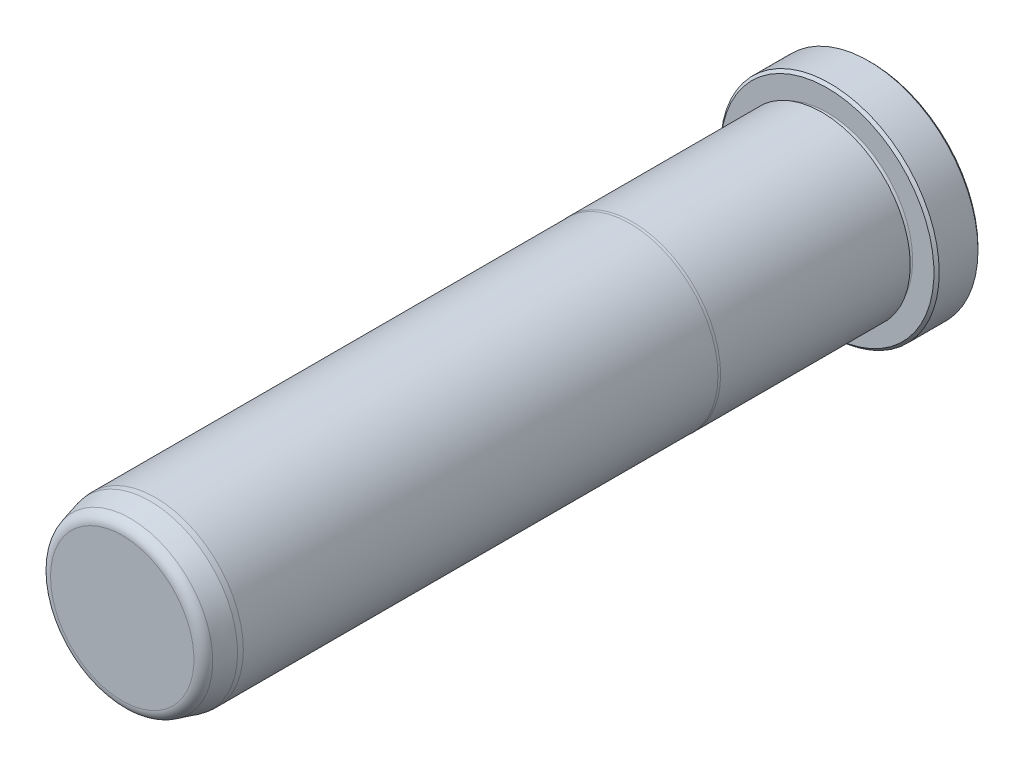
ISO-10303-21;
HEADER;
FILE_DESCRIPTION(('STEP AP214'),'2;1');
FILE_NAME('part.step','',(''),(''),'','','');
FILE_SCHEMA(('AUTOMOTIVE_DESIGN { 1 0 10303 214 1 1 1 1 }'));
ENDSEC;
DATA;
#1=APPLICATION_CONTEXT('core data for automotive mechanical design processes');
#2=APPLICATION_PROTOCOL_DEFINITION('international standard','automotive_design',2000,#1);
#3=PRODUCT_CONTEXT('',#1,'mechanical');
#4=PRODUCT('Part','Part','',(#3));
#5=PRODUCT_RELATED_PRODUCT_CATEGORY('part','',(#4));
#6=PRODUCT_DEFINITION_FORMATION('','',#4);
#7=PRODUCT_DEFINITION_CONTEXT('part definition',#1,'design');
#8=PRODUCT_DEFINITION('design','',#6,#7);
#9=PRODUCT_DEFINITION_SHAPE('','',#8);
#10=(LENGTH_UNIT() NAMED_UNIT(*) SI_UNIT(.MILLI.,.METRE.));
#11=(NAMED_UNIT(*) PLANE_ANGLE_UNIT() SI_UNIT($,.RADIAN.));
#12=(NAMED_UNIT(*) SI_UNIT($,.STERADIAN.) SOLID_ANGLE_UNIT());
#13=UNCERTAINTY_MEASURE_WITH_UNIT(LENGTH_MEASURE(1.E-05),#10,'distance_accuracy_value','');
#14=(GEOMETRIC_REPRESENTATION_CONTEXT(3) GLOBAL_UNCERTAINTY_ASSIGNED_CONTEXT((#13)) GLOBAL_UNIT_ASSIGNED_CONTEXT((#10,
#11,#12)) REPRESENTATION_CONTEXT('',''));
#15=CARTESIAN_POINT('',(0.,0.,0.));
#16=DIRECTION('',(0.,0.,1.));
#17=DIRECTION('',(1.,0.,0.));
#18=AXIS2_PLACEMENT_3D('',#15,#16,#17);
#19=CARTESIAN_POINT('',(0.,0.,0.));
#20=DIRECTION('',(0.,0.,1.));
#21=DIRECTION('',(1.,0.,0.));
#22=AXIS2_PLACEMENT_3D('',#19,#20,#21);
#23=PLANE('',#22);
#24=CARTESIAN_POINT('',(0.,0.,0.));
#25=DIRECTION('',(0.,0.,1.));
#26=DIRECTION('',(1.,0.,0.));
#27=AXIS2_PLACEMENT_3D('',#24,#25,#26);
#28=CIRCLE('',#27,15.367);
#29=CARTESIAN_POINT('',(15.367,0.,0.));
#30=VERTEX_POINT('',#29);
#31=EDGE_CURVE('E37',#30,#30,#28,.F.);
#32=ORIENTED_EDGE('',*,*,#31,.T.);
#33=EDGE_LOOP('',(#32));
#34=FACE_BOUND('',#33,.T.);
#35=ADVANCED_FACE('F30',(#34),#23,.F.);
#36=CARTESIAN_POINT('',(0.,0.,0.));
#37=DIRECTION('',(0.,0.,1.));
#38=DIRECTION('',(1.,0.,0.));
#39=AXIS2_PLACEMENT_3D('',#36,#37,#38);
#40=CYLINDRICAL_SURFACE('',#39,15.748);
#41=CARTESIAN_POINT('',(0.,0.,0.38100000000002));
#42=DIRECTION('',(0.,0.,1.));
#43=DIRECTION('',(1.,0.,0.));
#44=AXIS2_PLACEMENT_3D('',#41,#42,#43);
#45=CIRCLE('',#44,15.748);
#46=CARTESIAN_POINT('',(15.748,0.,0.38100000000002));
#47=VERTEX_POINT('',#46);
#48=EDGE_CURVE('E41',#47,#47,#45,.T.);
#49=ORIENTED_EDGE('',*,*,#48,.T.);
#50=EDGE_LOOP('',(#49));
#51=FACE_BOUND('',#50,.T.);
#52=CARTESIAN_POINT('',(0.,0.,5.96900000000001));
#53=DIRECTION('',(0.,0.,-1.));
#54=DIRECTION('',(-1.,0.,0.));
#55=AXIS2_PLACEMENT_3D('',#52,#53,#54);
#56=CIRCLE('',#55,15.748);
#57=CARTESIAN_POINT('',(-15.748,0.,5.96900000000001));
#58=VERTEX_POINT('',#57);
#59=EDGE_CURVE('E45',#58,#58,#56,.T.);
#60=ORIENTED_EDGE('',*,*,#59,.T.);
#61=EDGE_LOOP('',(#60));
#62=FACE_BOUND('',#61,.T.);
#63=ADVANCED_FACE('F118',(#51,#62),#40,.T.);
#64=CARTESIAN_POINT('',(0.,15.748,6.35));
#65=DIRECTION('',(0.,0.,-1.));
#66=DIRECTION('',(-1.,0.,0.));
#67=AXIS2_PLACEMENT_3D('',#64,#65,#66);
#68=PLANE('',#67);
#69=CARTESIAN_POINT('',(0.,0.,6.35));
#70=DIRECTION('',(0.,0.,-1.));
#71=DIRECTION('',(-1.,0.,0.));
#72=AXIS2_PLACEMENT_3D('',#69,#70,#71);
#73=CIRCLE('',#72,15.367);
#74=CARTESIAN_POINT('',(-15.367,0.,6.35));
#75=VERTEX_POINT('',#74);
#76=EDGE_CURVE('E10',#75,#75,#73,.F.);
#77=ORIENTED_EDGE('',*,*,#76,.T.);
#78=EDGE_LOOP('',(#77));
#79=FACE_BOUND('',#78,.T.);
#80=CARTESIAN_POINT('',(0.,0.,6.35));
#81=DIRECTION('',(0.,0.,1.));
#82=DIRECTION('',(1.,0.,0.));
#83=AXIS2_PLACEMENT_3D('',#80,#81,#82);
#84=CIRCLE('',#83,12.3063);
#85=CARTESIAN_POINT('',(12.3063,0.,6.35));
#86=VERTEX_POINT('',#85);
#87=EDGE_CURVE('E56',#86,#86,#84,.T.);
#88=ORIENTED_EDGE('',*,*,#87,.F.);
#89=EDGE_LOOP('',(#88));
#90=FACE_BOUND('',#89,.T.);
#91=ADVANCED_FACE('F113',(#79,#90),#68,.F.);
#92=CARTESIAN_POINT('',(0.,0.,6.731));
#93=DIRECTION('',(0.,0.,1.));
#94=DIRECTION('',(1.,0.,0.));
#95=AXIS2_PLACEMENT_3D('',#92,#93,#94);
#96=TOROIDAL_SURFACE('',#95,12.3063,0.381);
#97=CARTESIAN_POINT('',(0.,0.,7.112));
#98=DIRECTION('',(0.,0.,1.));
#99=DIRECTION('',(1.,0.,0.));
#100=AXIS2_PLACEMENT_3D('',#97,#98,#99);
#101=CIRCLE('',#100,12.3063);
#102=CARTESIAN_POINT('',(12.3063,0.,7.112));
#103=VERTEX_POINT('',#102);
#104=EDGE_CURVE('E59',#103,#103,#101,.T.);
#105=ORIENTED_EDGE('',*,*,#104,.F.);
#106=EDGE_LOOP('',(#105));
#107=FACE_BOUND('',#106,.T.);
#108=ORIENTED_EDGE('',*,*,#87,.T.);
#109=EDGE_LOOP('',(#108));
#110=FACE_BOUND('',#109,.T.);
#111=ADVANCED_FACE('F107',(#107,#110),#96,.F.);
#112=CARTESIAN_POINT('',(0.,12.3063,7.112));
#113=DIRECTION('',(0.,0.,1.));
#114=DIRECTION('',(1.,0.,0.));
#115=AXIS2_PLACEMENT_3D('',#112,#113,#114);
#116=PLANE('',#115);
#117=CARTESIAN_POINT('',(0.,0.,7.112));
#118=DIRECTION('',(0.,0.,1.));
#119=DIRECTION('',(1.,0.,0.));
#120=AXIS2_PLACEMENT_3D('',#117,#118,#119);
#121=CIRCLE('',#120,12.7127);
#122=CARTESIAN_POINT('',(12.7127,0.,7.112));
#123=VERTEX_POINT('',#122);
#124=EDGE_CURVE('E62',#123,#123,#121,.T.);
#125=ORIENTED_EDGE('',*,*,#124,.F.);
#126=EDGE_LOOP('',(#125));
#127=FACE_BOUND('',#126,.T.);
#128=ORIENTED_EDGE('',*,*,#104,.T.);
#129=EDGE_LOOP('',(#128));
#130=FACE_BOUND('',#129,.T.);
#131=ADVANCED_FACE('F101',(#127,#130),#116,.F.);
#132=CARTESIAN_POINT('',(0.,0.,0.));
#133=DIRECTION('',(0.,0.,1.));
#134=DIRECTION('',(1.,0.,0.));
#135=AXIS2_PLACEMENT_3D('',#132,#133,#134);
#136=CYLINDRICAL_SURFACE('',#135,12.7127);
#137=CARTESIAN_POINT('',(0.,0.,34.4347630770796));
#138=DIRECTION('',(0.,0.,1.));
#139=DIRECTION('',(1.,0.,0.));
#140=AXIS2_PLACEMENT_3D('',#137,#138,#139);
#141=CIRCLE('',#140,12.7127);
#142=CARTESIAN_POINT('',(12.7127,0.,34.4347630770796));
#143=VERTEX_POINT('',#142);
#144=EDGE_CURVE('E65',#143,#143,#141,.T.);
#145=ORIENTED_EDGE('',*,*,#144,.F.);
#146=EDGE_LOOP('',(#145));
#147=FACE_BOUND('',#146,.T.);
#148=ORIENTED_EDGE('',*,*,#124,.T.);
#149=EDGE_LOOP('',(#148));
#150=FACE_BOUND('',#149,.T.);
#151=ADVANCED_FACE('F95',(#147,#150),#136,.T.);
#152=CARTESIAN_POINT('',(0.,0.,34.4347630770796));
#153=DIRECTION('',(0.,0.,-1.));
#154=DIRECTION('',(-1.,0.,0.));
#155=AXIS2_PLACEMENT_3D('',#152,#153,#154);
#156=CONICAL_SURFACE('',#155,12.7127,0.0698131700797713);
#157=CARTESIAN_POINT('',(0.,0.,34.798));
#158=DIRECTION('',(0.,0.,1.));
#159=DIRECTION('',(1.,0.,0.));
#160=AXIS2_PLACEMENT_3D('',#157,#158,#159);
#161=CIRCLE('',#160,12.6873);
#162=CARTESIAN_POINT('',(12.6873,0.,34.798));
#163=VERTEX_POINT('',#162);
#164=EDGE_CURVE('E68',#163,#163,#161,.T.);
#165=ORIENTED_EDGE('',*,*,#164,.F.);
#166=EDGE_LOOP('',(#165));
#167=FACE_BOUND('',#166,.T.);
#168=ORIENTED_EDGE('',*,*,#144,.T.);
#169=EDGE_LOOP('',(#168));
#170=FACE_BOUND('',#169,.T.);
#171=ADVANCED_FACE('F89',(#167,#170),#156,.T.);
#172=CARTESIAN_POINT('',(0.,0.,0.));
#173=DIRECTION('',(0.,0.,1.));
#174=DIRECTION('',(1.,0.,0.));
#175=AXIS2_PLACEMENT_3D('',#172,#173,#174);
#176=CYLINDRICAL_SURFACE('',#175,12.6873);
#177=CARTESIAN_POINT('',(0.,0.,103.1875));
#178=DIRECTION('',(0.,0.,1.));
#179=DIRECTION('',(1.,0.,0.));
#180=AXIS2_PLACEMENT_3D('',#177,#178,#179);
#181=CIRCLE('',#180,12.6873);
#182=CARTESIAN_POINT('',(12.6873,0.,103.1875));
#183=VERTEX_POINT('',#182);
#184=EDGE_CURVE('E71',#183,#183,#181,.T.);
#185=ORIENTED_EDGE('',*,*,#184,.F.);
#186=EDGE_LOOP('',(#185));
#187=FACE_BOUND('',#186,.T.);
#188=ORIENTED_EDGE('',*,*,#164,.T.);
#189=EDGE_LOOP('',(#188));
#190=FACE_BOUND('',#189,.T.);
#191=ADVANCED_FACE('F83',(#187,#190),#176,.T.);
#192=CARTESIAN_POINT('',(0.,0.,103.1875));
#193=DIRECTION('',(0.,0.,-1.));
#194=DIRECTION('',(-1.,0.,0.));
#195=AXIS2_PLACEMENT_3D('',#192,#193,#194);
#196=CONICAL_SURFACE('',#195,12.6873,0.0872664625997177);
#197=CARTESIAN_POINT('',(0.,0.,103.9495));
#198=DIRECTION('',(0.,0.,1.));
#199=DIRECTION('',(1.,0.,0.));
#200=AXIS2_PLACEMENT_3D('',#197,#198,#199);
#201=CIRCLE('',#200,12.6206336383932);
#202=CARTESIAN_POINT('',(12.6206336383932,0.,103.9495));
#203=VERTEX_POINT('',#202);
#204=EDGE_CURVE('E74',#203,#203,#201,.T.);
#205=ORIENTED_EDGE('',*,*,#204,.F.);
#206=EDGE_LOOP('',(#205));
#207=FACE_BOUND('',#206,.T.);
#208=ORIENTED_EDGE('',*,*,#184,.T.);
#209=EDGE_LOOP('',(#208));
#210=FACE_BOUND('',#209,.T.);
#211=ADVANCED_FACE('F80',(#207,#210),#196,.T.);
#212=CARTESIAN_POINT('',(0.,0.,103.9495));
#213=DIRECTION('',(0.,0.,-1.));
#214=DIRECTION('',(-1.,0.,0.));
#215=AXIS2_PLACEMENT_3D('',#212,#213,#214);
#216=CONICAL_SURFACE('',#215,12.6206336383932,0.261799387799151);
#217=CARTESIAN_POINT('',(0.,0.,106.7733752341));
#218=DIRECTION('',(0.,0.,1.));
#219=DIRECTION('',(1.,0.,0.));
#220=AXIS2_PLACEMENT_3D('',#217,#218,#219);
#221=CIRCLE('',#220,11.8639785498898);
#222=CARTESIAN_POINT('',(11.8639785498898,0.,106.7733752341));
#223=VERTEX_POINT('',#222);
#224=EDGE_CURVE('E50',#223,#223,#221,.F.);
#225=ORIENTED_EDGE('',*,*,#224,.T.);
#226=EDGE_LOOP('',(#225));
#227=FACE_BOUND('',#226,.T.);
#228=ORIENTED_EDGE('',*,*,#204,.T.);
#229=EDGE_LOOP('',(#228));
#230=FACE_BOUND('',#229,.T.);
#231=ADVANCED_FACE('F78',(#227,#230),#216,.T.);
#232=CARTESIAN_POINT('',(0.,11.5487028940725,107.95));
#233=DIRECTION('',(0.,0.,-1.));
#234=DIRECTION('',(-1.,0.,0.));
#235=AXIS2_PLACEMENT_3D('',#232,#233,#234);
#236=PLANE('',#235);
#237=CARTESIAN_POINT('',(0.,0.,107.95));
#238=DIRECTION('',(0.,0.,-1.));
#239=DIRECTION('',(-1.,0.,0.));
#240=AXIS2_PLACEMENT_3D('',#237,#238,#239);
#241=CIRCLE('',#240,10.3305713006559);
#242=CARTESIAN_POINT('',(-10.3305713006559,0.,107.95));
#243=VERTEX_POINT('',#242);
#244=EDGE_CURVE('E53',#243,#243,#241,.F.);
#245=ORIENTED_EDGE('',*,*,#244,.T.);
#246=EDGE_LOOP('',(#245));
#247=FACE_BOUND('',#246,.T.);
#248=ADVANCED_FACE('F133',(#247),#236,.F.);
#249=CARTESIAN_POINT('',(0.,0.,106.3625));
#250=DIRECTION('',(0.,0.,-1.));
#251=DIRECTION('',(-1.,0.,0.));
#252=AXIS2_PLACEMENT_3D('',#249,#250,#251);
#253=TOROIDAL_SURFACE('',#252,10.3305713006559,1.5875);
#254=ORIENTED_EDGE('',*,*,#224,.F.);
#255=EDGE_LOOP('',(#254));
#256=FACE_BOUND('',#255,.T.);
#257=ORIENTED_EDGE('',*,*,#244,.F.);
#258=EDGE_LOOP('',(#257));
#259=FACE_BOUND('',#258,.T.);
#260=ADVANCED_FACE('F130',(#256,#259),#253,.T.);
#261=CARTESIAN_POINT('',(0.,0.,0.38100000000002));
#262=DIRECTION('',(0.,0.,1.));
#263=DIRECTION('',(1.,0.,0.));
#264=AXIS2_PLACEMENT_3D('',#261,#262,#263);
#265=CONICAL_SURFACE('',#264,15.748,0.78539816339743);
#266=ORIENTED_EDGE('',*,*,#31,.F.);
#267=EDGE_LOOP('',(#266));
#268=FACE_BOUND('',#267,.T.);
#269=ORIENTED_EDGE('',*,*,#48,.F.);
#270=EDGE_LOOP('',(#269));
#271=FACE_BOUND('',#270,.T.);
#272=ADVANCED_FACE('F132',(#268,#271),#265,.T.);
#273=CARTESIAN_POINT('',(0.,0.,6.35));
#274=DIRECTION('',(0.,0.,-1.));
#275=DIRECTION('',(-1.,0.,0.));
#276=AXIS2_PLACEMENT_3D('',#273,#274,#275);
#277=CONICAL_SURFACE('',#276,15.367,0.78539816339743);
#278=ORIENTED_EDGE('',*,*,#59,.F.);
#279=EDGE_LOOP('',(#278));
#280=FACE_BOUND('',#279,.T.);
#281=ORIENTED_EDGE('',*,*,#76,.F.);
#282=EDGE_LOOP('',(#281));
#283=FACE_BOUND('',#282,.T.);
#284=ADVANCED_FACE('F32',(#280,#283),#277,.T.);
#285=CLOSED_SHELL('',(#35,#63,#91,#111,#131,#151,#171,#191,#211,#231,#248,#260,#272,#284));
#286=MANIFOLD_SOLID_BREP('B2',#285);
#287=ADVANCED_BREP_SHAPE_REPRESENTATION('',(#18,#286),#14);
#288=SHAPE_DEFINITION_REPRESENTATION(#9,#287);
ENDSEC;
END-ISO-10303-21;
